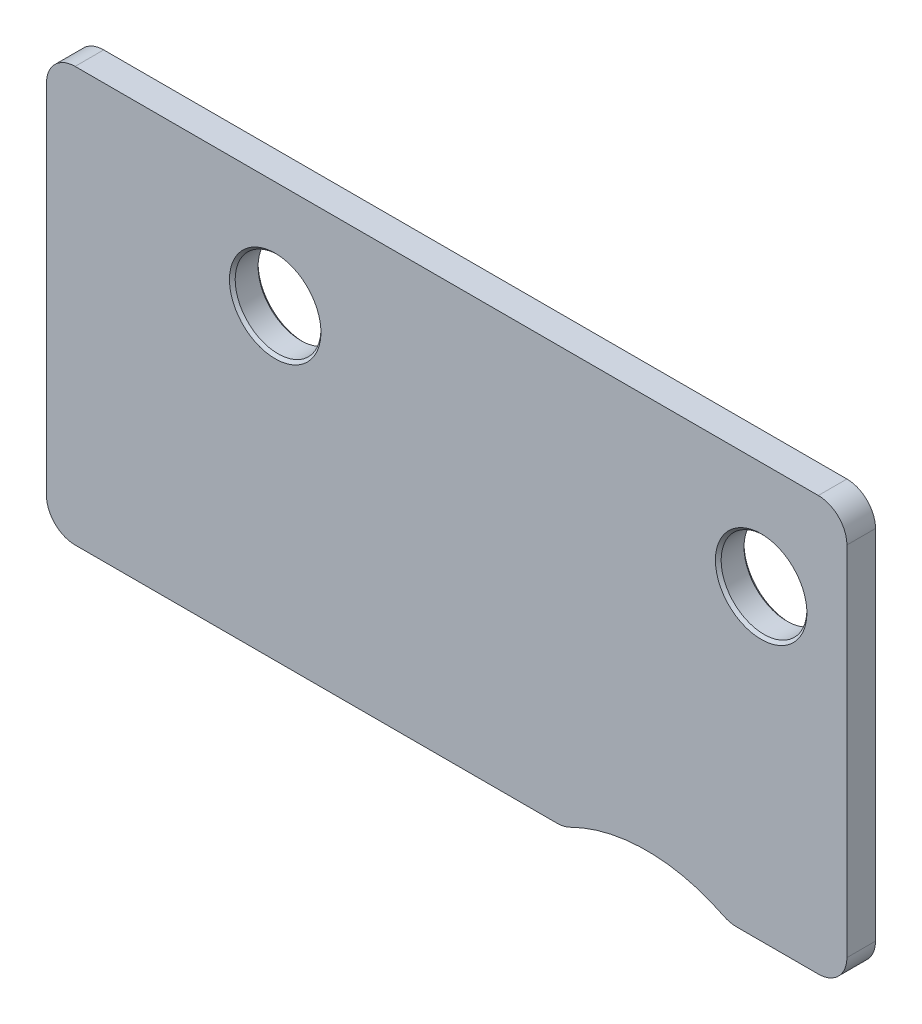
ISO-10303-21;
HEADER;
FILE_DESCRIPTION(('STEP AP214'),'2;1');
FILE_NAME('part.step','',(''),(''),'','','');
FILE_SCHEMA(('AUTOMOTIVE_DESIGN { 1 0 10303 214 1 1 1 1 }'));
ENDSEC;
DATA;
#1=APPLICATION_CONTEXT('core data for automotive mechanical design processes');
#2=APPLICATION_PROTOCOL_DEFINITION('international standard','automotive_design',2000,#1);
#3=PRODUCT_CONTEXT('',#1,'mechanical');
#4=PRODUCT('Part','Part','',(#3));
#5=PRODUCT_RELATED_PRODUCT_CATEGORY('part','',(#4));
#6=PRODUCT_DEFINITION_FORMATION('','',#4);
#7=PRODUCT_DEFINITION_CONTEXT('part definition',#1,'design');
#8=PRODUCT_DEFINITION('design','',#6,#7);
#9=PRODUCT_DEFINITION_SHAPE('','',#8);
#10=(LENGTH_UNIT() NAMED_UNIT(*) SI_UNIT(.MILLI.,.METRE.));
#11=(NAMED_UNIT(*) PLANE_ANGLE_UNIT() SI_UNIT($,.RADIAN.));
#12=(NAMED_UNIT(*) SI_UNIT($,.STERADIAN.) SOLID_ANGLE_UNIT());
#13=UNCERTAINTY_MEASURE_WITH_UNIT(LENGTH_MEASURE(1.E-05),#10,'distance_accuracy_value','');
#14=(GEOMETRIC_REPRESENTATION_CONTEXT(3) GLOBAL_UNCERTAINTY_ASSIGNED_CONTEXT((#13)) GLOBAL_UNIT_ASSIGNED_CONTEXT((#10,
#11,#12)) REPRESENTATION_CONTEXT('',''));
#15=CARTESIAN_POINT('',(0.,0.,0.));
#16=DIRECTION('',(0.,0.,1.));
#17=DIRECTION('',(1.,0.,0.));
#18=AXIS2_PLACEMENT_3D('',#15,#16,#17);
#19=CARTESIAN_POINT('',(21.,-19.7583187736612,1.));
#20=DIRECTION('',(0.,0.,-1.));
#21=DIRECTION('',(-1.,0.,0.));
#22=AXIS2_PLACEMENT_3D('',#19,#20,#21);
#23=PLANE('',#22);
#24=CARTESIAN_POINT('',(25.,-3.75831877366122,1.));
#25=DIRECTION('',(0.,0.,-1.));
#26=DIRECTION('',(-1.,0.,0.));
#27=AXIS2_PLACEMENT_3D('',#24,#25,#26);
#28=CIRCLE('',#27,1.6);
#29=CARTESIAN_POINT('',(23.4,-3.75831877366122,1.));
#30=VERTEX_POINT('',#29);
#31=EDGE_CURVE('E11',#30,#30,#28,.T.);
#32=ORIENTED_EDGE('',*,*,#31,.T.);
#33=EDGE_LOOP('',(#32));
#34=FACE_BOUND('',#33,.T.);
#35=CARTESIAN_POINT('',(8.,-3.75831877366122,1.));
#36=DIRECTION('',(0.,0.,-1.));
#37=DIRECTION('',(-1.,0.,0.));
#38=AXIS2_PLACEMENT_3D('',#35,#36,#37);
#39=CIRCLE('',#38,1.6);
#40=CARTESIAN_POINT('',(6.4,-3.75831877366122,1.));
#41=VERTEX_POINT('',#40);
#42=EDGE_CURVE('E370',#41,#41,#39,.T.);
#43=ORIENTED_EDGE('',*,*,#42,.T.);
#44=EDGE_LOOP('',(#43));
#45=FACE_BOUND('',#44,.T.);
#46=DIRECTION('',(1.,0.,0.));
#47=VECTOR('',#46,1.);
#48=CARTESIAN_POINT('',(0.,-14.5,1.));
#49=LINE('',#48,#47);
#50=CARTESIAN_POINT('',(1.,-14.5,1.));
#51=VERTEX_POINT('',#50);
#52=CARTESIAN_POINT('',(17.8641673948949,-14.5,1.));
#53=VERTEX_POINT('',#52);
#54=EDGE_CURVE('E496',#51,#53,#49,.T.);
#55=ORIENTED_EDGE('',*,*,#54,.T.);
#56=CARTESIAN_POINT('',(17.864167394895,-13.5,1.));
#57=DIRECTION('',(0.,0.,-1.));
#58=DIRECTION('',(-1.,0.,0.));
#59=AXIS2_PLACEMENT_3D('',#56,#57,#58);
#60=CIRCLE('',#59,1.);
#61=CARTESIAN_POINT('',(18.3121434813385,-14.3940455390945,1.));
#62=VERTEX_POINT('',#61);
#63=EDGE_CURVE('E528',#53,#62,#60,.F.);
#64=ORIENTED_EDGE('',*,*,#63,.T.);
#65=CARTESIAN_POINT('',(21.,-19.7583187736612,1.));
#66=DIRECTION('',(0.,0.,-1.));
#67=DIRECTION('',(-1.,0.,0.));
#68=AXIS2_PLACEMENT_3D('',#65,#66,#67);
#69=CIRCLE('',#68,6.);
#70=CARTESIAN_POINT('',(23.6878565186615,-14.3940455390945,1.));
#71=VERTEX_POINT('',#70);
#72=EDGE_CURVE('E473',#62,#71,#69,.T.);
#73=ORIENTED_EDGE('',*,*,#72,.T.);
#74=CARTESIAN_POINT('',(24.135832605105,-13.5,1.));
#75=DIRECTION('',(0.,0.,-1.));
#76=DIRECTION('',(-1.,0.,0.));
#77=AXIS2_PLACEMENT_3D('',#74,#75,#76);
#78=CIRCLE('',#77,1.);
#79=CARTESIAN_POINT('',(24.135832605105,-14.5,1.));
#80=VERTEX_POINT('',#79);
#81=EDGE_CURVE('E526',#71,#80,#78,.F.);
#82=ORIENTED_EDGE('',*,*,#81,.T.);
#83=DIRECTION('',(1.,0.,0.));
#84=VECTOR('',#83,1.);
#85=CARTESIAN_POINT('',(23.8896511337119,-14.5,1.));
#86=LINE('',#85,#84);
#87=CARTESIAN_POINT('',(27.,-14.5,1.));
#88=VERTEX_POINT('',#87);
#89=EDGE_CURVE('E500',#80,#88,#86,.T.);
#90=ORIENTED_EDGE('',*,*,#89,.T.);
#91=CARTESIAN_POINT('',(27.,-13.5,1.));
#92=DIRECTION('',(0.,0.,-1.));
#93=DIRECTION('',(-1.,0.,0.));
#94=AXIS2_PLACEMENT_3D('',#91,#92,#93);
#95=CIRCLE('',#94,1.);
#96=CARTESIAN_POINT('',(28.,-13.5,1.));
#97=VERTEX_POINT('',#96);
#98=EDGE_CURVE('E520',#88,#97,#95,.F.);
#99=ORIENTED_EDGE('',*,*,#98,.T.);
#100=DIRECTION('',(0.,1.,0.));
#101=VECTOR('',#100,1.);
#102=CARTESIAN_POINT('',(28.,0.,1.));
#103=LINE('',#102,#101);
#104=CARTESIAN_POINT('',(28.,-1.,1.));
#105=VERTEX_POINT('',#104);
#106=EDGE_CURVE('E503',#97,#105,#103,.T.);
#107=ORIENTED_EDGE('',*,*,#106,.T.);
#108=CARTESIAN_POINT('',(27.,-1.,1.));
#109=DIRECTION('',(0.,0.,-1.));
#110=DIRECTION('',(-1.,0.,0.));
#111=AXIS2_PLACEMENT_3D('',#108,#109,#110);
#112=CIRCLE('',#111,1.);
#113=CARTESIAN_POINT('',(27.,0.,1.));
#114=VERTEX_POINT('',#113);
#115=EDGE_CURVE('E384',#105,#114,#112,.F.);
#116=ORIENTED_EDGE('',*,*,#115,.T.);
#117=DIRECTION('',(-1.,0.,0.));
#118=VECTOR('',#117,1.);
#119=CARTESIAN_POINT('',(0.,0.,1.));
#120=LINE('',#119,#118);
#121=CARTESIAN_POINT('',(1.,0.,1.));
#122=VERTEX_POINT('',#121);
#123=EDGE_CURVE('E505',#114,#122,#120,.T.);
#124=ORIENTED_EDGE('',*,*,#123,.T.);
#125=CARTESIAN_POINT('',(1.,-1.,1.));
#126=DIRECTION('',(0.,0.,-1.));
#127=DIRECTION('',(-1.,0.,0.));
#128=AXIS2_PLACEMENT_3D('',#125,#126,#127);
#129=CIRCLE('',#128,1.);
#130=CARTESIAN_POINT('',(0.,-1.,1.));
#131=VERTEX_POINT('',#130);
#132=EDGE_CURVE('E524',#122,#131,#129,.F.);
#133=ORIENTED_EDGE('',*,*,#132,.T.);
#134=DIRECTION('',(0.,-1.,0.));
#135=VECTOR('',#134,1.);
#136=CARTESIAN_POINT('',(0.,0.,1.));
#137=LINE('',#136,#135);
#138=CARTESIAN_POINT('',(0.,-13.5,1.));
#139=VERTEX_POINT('',#138);
#140=EDGE_CURVE('E493',#131,#139,#137,.T.);
#141=ORIENTED_EDGE('',*,*,#140,.T.);
#142=CARTESIAN_POINT('',(1.,-13.5,1.));
#143=DIRECTION('',(0.,0.,-1.));
#144=DIRECTION('',(-1.,0.,0.));
#145=AXIS2_PLACEMENT_3D('',#142,#143,#144);
#146=CIRCLE('',#145,1.);
#147=EDGE_CURVE('E522',#139,#51,#146,.F.);
#148=ORIENTED_EDGE('',*,*,#147,.T.);
#149=EDGE_LOOP('',(#55,#64,#73,#82,#90,#99,#107,#116,#124,#133,#141,#148));
#150=FACE_BOUND('',#149,.T.);
#151=ADVANCED_FACE('F362',(#34,#45,#150),#23,.F.);
#152=CARTESIAN_POINT('',(21.,-19.7583187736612,0.));
#153=DIRECTION('',(0.,0.,-1.));
#154=DIRECTION('',(-1.,0.,0.));
#155=AXIS2_PLACEMENT_3D('',#152,#153,#154);
#156=PLANE('',#155);
#157=CARTESIAN_POINT('',(8.,-3.75831877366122,0.));
#158=DIRECTION('',(0.,0.,-1.));
#159=DIRECTION('',(-1.,0.,0.));
#160=AXIS2_PLACEMENT_3D('',#157,#158,#159);
#161=CIRCLE('',#160,1.6);
#162=CARTESIAN_POINT('',(6.4,-3.75831877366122,0.));
#163=VERTEX_POINT('',#162);
#164=EDGE_CURVE('E552',#163,#163,#161,.F.);
#165=ORIENTED_EDGE('',*,*,#164,.T.);
#166=EDGE_LOOP('',(#165));
#167=FACE_BOUND('',#166,.T.);
#168=CARTESIAN_POINT('',(25.,-3.75831877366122,0.));
#169=DIRECTION('',(0.,0.,-1.));
#170=DIRECTION('',(-1.,0.,0.));
#171=AXIS2_PLACEMENT_3D('',#168,#169,#170);
#172=CIRCLE('',#171,1.6);
#173=CARTESIAN_POINT('',(23.4,-3.75831877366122,0.));
#174=VERTEX_POINT('',#173);
#175=EDGE_CURVE('E549',#174,#174,#172,.F.);
#176=ORIENTED_EDGE('',*,*,#175,.T.);
#177=EDGE_LOOP('',(#176));
#178=FACE_BOUND('',#177,.T.);
#179=CARTESIAN_POINT('',(21.,-19.7583187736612,0.));
#180=DIRECTION('',(0.,0.,-1.));
#181=DIRECTION('',(-1.,0.,0.));
#182=AXIS2_PLACEMENT_3D('',#179,#180,#181);
#183=CIRCLE('',#182,6.);
#184=CARTESIAN_POINT('',(18.3121434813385,-14.3940455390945,0.));
#185=VERTEX_POINT('',#184);
#186=CARTESIAN_POINT('',(23.6878565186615,-14.3940455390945,0.));
#187=VERTEX_POINT('',#186);
#188=EDGE_CURVE('E470',#185,#187,#183,.T.);
#189=ORIENTED_EDGE('',*,*,#188,.F.);
#190=CARTESIAN_POINT('',(17.864167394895,-13.5,0.));
#191=DIRECTION('',(0.,0.,-1.));
#192=DIRECTION('',(-1.,0.,0.));
#193=AXIS2_PLACEMENT_3D('',#190,#191,#192);
#194=CIRCLE('',#193,1.);
#195=CARTESIAN_POINT('',(17.8641673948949,-14.5,0.));
#196=VERTEX_POINT('',#195);
#197=EDGE_CURVE('E453',#185,#196,#194,.T.);
#198=ORIENTED_EDGE('',*,*,#197,.T.);
#199=DIRECTION('',(1.,0.,0.));
#200=VECTOR('',#199,1.);
#201=CARTESIAN_POINT('',(0.,-14.5,0.));
#202=LINE('',#201,#200);
#203=CARTESIAN_POINT('',(1.,-14.5,0.));
#204=VERTEX_POINT('',#203);
#205=EDGE_CURVE('E480',#204,#196,#202,.T.);
#206=ORIENTED_EDGE('',*,*,#205,.F.);
#207=CARTESIAN_POINT('',(1.,-13.5,0.));
#208=DIRECTION('',(0.,0.,-1.));
#209=DIRECTION('',(-1.,0.,0.));
#210=AXIS2_PLACEMENT_3D('',#207,#208,#209);
#211=CIRCLE('',#210,1.);
#212=CARTESIAN_POINT('',(0.,-13.5,0.));
#213=VERTEX_POINT('',#212);
#214=EDGE_CURVE('E511',#204,#213,#211,.T.);
#215=ORIENTED_EDGE('',*,*,#214,.T.);
#216=DIRECTION('',(0.,-1.,0.));
#217=VECTOR('',#216,1.);
#218=CARTESIAN_POINT('',(0.,0.,0.));
#219=LINE('',#218,#217);
#220=CARTESIAN_POINT('',(0.,-1.,0.));
#221=VERTEX_POINT('',#220);
#222=EDGE_CURVE('E485',#221,#213,#219,.T.);
#223=ORIENTED_EDGE('',*,*,#222,.F.);
#224=CARTESIAN_POINT('',(1.,-1.,0.));
#225=DIRECTION('',(0.,0.,-1.));
#226=DIRECTION('',(-1.,0.,0.));
#227=AXIS2_PLACEMENT_3D('',#224,#225,#226);
#228=CIRCLE('',#227,1.);
#229=CARTESIAN_POINT('',(1.,0.,0.));
#230=VERTEX_POINT('',#229);
#231=EDGE_CURVE('E513',#221,#230,#228,.T.);
#232=ORIENTED_EDGE('',*,*,#231,.T.);
#233=DIRECTION('',(-1.,0.,0.));
#234=VECTOR('',#233,1.);
#235=CARTESIAN_POINT('',(0.,0.,0.));
#236=LINE('',#235,#234);
#237=CARTESIAN_POINT('',(27.,0.,0.));
#238=VERTEX_POINT('',#237);
#239=EDGE_CURVE('E491',#238,#230,#236,.T.);
#240=ORIENTED_EDGE('',*,*,#239,.F.);
#241=CARTESIAN_POINT('',(27.,-1.,0.));
#242=DIRECTION('',(0.,0.,-1.));
#243=DIRECTION('',(-1.,0.,0.));
#244=AXIS2_PLACEMENT_3D('',#241,#242,#243);
#245=CIRCLE('',#244,1.);
#246=CARTESIAN_POINT('',(28.,-1.,0.));
#247=VERTEX_POINT('',#246);
#248=EDGE_CURVE('E474',#238,#247,#245,.T.);
#249=ORIENTED_EDGE('',*,*,#248,.T.);
#250=DIRECTION('',(0.,1.,0.));
#251=VECTOR('',#250,1.);
#252=CARTESIAN_POINT('',(28.,0.,0.));
#253=LINE('',#252,#251);
#254=CARTESIAN_POINT('',(28.,-13.5,0.));
#255=VERTEX_POINT('',#254);
#256=EDGE_CURVE('E483',#255,#247,#253,.T.);
#257=ORIENTED_EDGE('',*,*,#256,.F.);
#258=CARTESIAN_POINT('',(27.,-13.5,0.));
#259=DIRECTION('',(0.,0.,-1.));
#260=DIRECTION('',(-1.,0.,0.));
#261=AXIS2_PLACEMENT_3D('',#258,#259,#260);
#262=CIRCLE('',#261,1.);
#263=CARTESIAN_POINT('',(27.,-14.5,0.));
#264=VERTEX_POINT('',#263);
#265=EDGE_CURVE('E509',#255,#264,#262,.T.);
#266=ORIENTED_EDGE('',*,*,#265,.T.);
#267=DIRECTION('',(1.,0.,0.));
#268=VECTOR('',#267,1.);
#269=CARTESIAN_POINT('',(23.8896511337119,-14.5,0.));
#270=LINE('',#269,#268);
#271=CARTESIAN_POINT('',(24.135832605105,-14.5,0.));
#272=VERTEX_POINT('',#271);
#273=EDGE_CURVE('E479',#272,#264,#270,.T.);
#274=ORIENTED_EDGE('',*,*,#273,.F.);
#275=CARTESIAN_POINT('',(24.135832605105,-13.5,0.));
#276=DIRECTION('',(0.,0.,-1.));
#277=DIRECTION('',(-1.,0.,0.));
#278=AXIS2_PLACEMENT_3D('',#275,#276,#277);
#279=CIRCLE('',#278,1.);
#280=EDGE_CURVE('E464',#272,#187,#279,.T.);
#281=ORIENTED_EDGE('',*,*,#280,.T.);
#282=EDGE_LOOP('',(#189,#198,#206,#215,#223,#232,#240,#249,#257,#266,#274,#281));
#283=FACE_BOUND('',#282,.T.);
#284=ADVANCED_FACE('F477',(#167,#178,#283),#156,.T.);
#285=CARTESIAN_POINT('',(0.,0.,1.));
#286=DIRECTION('',(1.,0.,0.));
#287=DIRECTION('',(0.,1.,0.));
#288=AXIS2_PLACEMENT_3D('',#285,#286,#287);
#289=PLANE('',#288);
#290=ORIENTED_EDGE('',*,*,#140,.F.);
#291=DIRECTION('',(0.,0.,-1.));
#292=VECTOR('',#291,1.);
#293=CARTESIAN_POINT('',(0.,-1.,1.));
#294=LINE('',#293,#292);
#295=EDGE_CURVE('E537',#131,#221,#294,.T.);
#296=ORIENTED_EDGE('',*,*,#295,.T.);
#297=ORIENTED_EDGE('',*,*,#222,.T.);
#298=DIRECTION('',(0.,0.,-1.));
#299=VECTOR('',#298,1.);
#300=CARTESIAN_POINT('',(0.,-13.5,1.));
#301=LINE('',#300,#299);
#302=EDGE_CURVE('E535',#213,#139,#301,.F.);
#303=ORIENTED_EDGE('',*,*,#302,.T.);
#304=EDGE_LOOP('',(#290,#296,#297,#303));
#305=FACE_BOUND('',#304,.T.);
#306=ADVANCED_FACE('F364',(#305),#289,.F.);
#307=CARTESIAN_POINT('',(0.,-14.5,1.));
#308=DIRECTION('',(0.,1.,0.));
#309=DIRECTION('',(0.,0.,1.));
#310=AXIS2_PLACEMENT_3D('',#307,#308,#309);
#311=PLANE('',#310);
#312=ORIENTED_EDGE('',*,*,#205,.T.);
#313=DIRECTION('',(0.,0.,-1.));
#314=VECTOR('',#313,1.);
#315=CARTESIAN_POINT('',(17.864167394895,-14.5,1.));
#316=LINE('',#315,#314);
#317=EDGE_CURVE('E458',#196,#53,#316,.F.);
#318=ORIENTED_EDGE('',*,*,#317,.T.);
#319=ORIENTED_EDGE('',*,*,#54,.F.);
#320=DIRECTION('',(0.,0.,-1.));
#321=VECTOR('',#320,1.);
#322=CARTESIAN_POINT('',(1.,-14.5,1.));
#323=LINE('',#322,#321);
#324=EDGE_CURVE('E463',#51,#204,#323,.T.);
#325=ORIENTED_EDGE('',*,*,#324,.T.);
#326=EDGE_LOOP('',(#312,#318,#319,#325));
#327=FACE_BOUND('',#326,.T.);
#328=ADVANCED_FACE('F613',(#327),#311,.F.);
#329=CARTESIAN_POINT('',(21.,-19.7583187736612,1.));
#330=DIRECTION('',(0.,0.,-1.));
#331=DIRECTION('',(-1.,0.,0.));
#332=AXIS2_PLACEMENT_3D('',#329,#330,#331);
#333=CYLINDRICAL_SURFACE('',#332,6.);
#334=ORIENTED_EDGE('',*,*,#72,.F.);
#335=DIRECTION('',(0.,0.,-1.));
#336=VECTOR('',#335,1.);
#337=CARTESIAN_POINT('',(18.3121434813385,-14.3940455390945,1.));
#338=LINE('',#337,#336);
#339=EDGE_CURVE('E457',#62,#185,#338,.T.);
#340=ORIENTED_EDGE('',*,*,#339,.T.);
#341=ORIENTED_EDGE('',*,*,#188,.T.);
#342=DIRECTION('',(0.,0.,-1.));
#343=VECTOR('',#342,1.);
#344=CARTESIAN_POINT('',(23.6878565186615,-14.3940455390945,1.));
#345=LINE('',#344,#343);
#346=EDGE_CURVE('E475',#187,#71,#345,.F.);
#347=ORIENTED_EDGE('',*,*,#346,.T.);
#348=EDGE_LOOP('',(#334,#340,#341,#347));
#349=FACE_BOUND('',#348,.T.);
#350=ADVANCED_FACE('F469',(#349),#333,.F.);
#351=CARTESIAN_POINT('',(23.8896511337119,-14.5,1.));
#352=DIRECTION('',(0.,1.,0.));
#353=DIRECTION('',(0.,0.,1.));
#354=AXIS2_PLACEMENT_3D('',#351,#352,#353);
#355=PLANE('',#354);
#356=ORIENTED_EDGE('',*,*,#89,.F.);
#357=DIRECTION('',(0.,0.,-1.));
#358=VECTOR('',#357,1.);
#359=CARTESIAN_POINT('',(24.135832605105,-14.5,1.));
#360=LINE('',#359,#358);
#361=EDGE_CURVE('E532',#80,#272,#360,.T.);
#362=ORIENTED_EDGE('',*,*,#361,.T.);
#363=ORIENTED_EDGE('',*,*,#273,.T.);
#364=DIRECTION('',(0.,0.,-1.));
#365=VECTOR('',#364,1.);
#366=CARTESIAN_POINT('',(27.,-14.5,1.));
#367=LINE('',#366,#365);
#368=EDGE_CURVE('E530',#264,#88,#367,.F.);
#369=ORIENTED_EDGE('',*,*,#368,.T.);
#370=EDGE_LOOP('',(#356,#362,#363,#369));
#371=FACE_BOUND('',#370,.T.);
#372=ADVANCED_FACE('F607',(#371),#355,.F.);
#373=CARTESIAN_POINT('',(28.,0.,1.));
#374=DIRECTION('',(-1.,0.,0.));
#375=DIRECTION('',(0.,-1.,0.));
#376=AXIS2_PLACEMENT_3D('',#373,#374,#375);
#377=PLANE('',#376);
#378=ORIENTED_EDGE('',*,*,#106,.F.);
#379=DIRECTION('',(0.,0.,-1.));
#380=VECTOR('',#379,1.);
#381=CARTESIAN_POINT('',(28.,-13.5,1.));
#382=LINE('',#381,#380);
#383=EDGE_CURVE('E546',#97,#255,#382,.T.);
#384=ORIENTED_EDGE('',*,*,#383,.T.);
#385=ORIENTED_EDGE('',*,*,#256,.T.);
#386=DIRECTION('',(0.,0.,-1.));
#387=VECTOR('',#386,1.);
#388=CARTESIAN_POINT('',(28.,-1.,1.));
#389=LINE('',#388,#387);
#390=EDGE_CURVE('E544',#247,#105,#389,.F.);
#391=ORIENTED_EDGE('',*,*,#390,.T.);
#392=EDGE_LOOP('',(#378,#384,#385,#391));
#393=FACE_BOUND('',#392,.T.);
#394=ADVANCED_FACE('F604',(#393),#377,.F.);
#395=CARTESIAN_POINT('',(0.,0.,1.));
#396=DIRECTION('',(0.,-1.,0.));
#397=DIRECTION('',(0.,0.,-1.));
#398=AXIS2_PLACEMENT_3D('',#395,#396,#397);
#399=PLANE('',#398);
#400=ORIENTED_EDGE('',*,*,#239,.T.);
#401=DIRECTION('',(0.,0.,-1.));
#402=VECTOR('',#401,1.);
#403=CARTESIAN_POINT('',(1.,0.,1.));
#404=LINE('',#403,#402);
#405=EDGE_CURVE('E377',#230,#122,#404,.F.);
#406=ORIENTED_EDGE('',*,*,#405,.T.);
#407=ORIENTED_EDGE('',*,*,#123,.F.);
#408=DIRECTION('',(0.,0.,-1.));
#409=VECTOR('',#408,1.);
#410=CARTESIAN_POINT('',(27.,0.,1.));
#411=LINE('',#410,#409);
#412=EDGE_CURVE('E540',#114,#238,#411,.T.);
#413=ORIENTED_EDGE('',*,*,#412,.T.);
#414=EDGE_LOOP('',(#400,#406,#407,#413));
#415=FACE_BOUND('',#414,.T.);
#416=ADVANCED_FACE('F589',(#415),#399,.F.);
#417=CARTESIAN_POINT('',(25.,-3.75831877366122,1.));
#418=DIRECTION('',(0.,0.,-1.));
#419=DIRECTION('',(-1.,0.,0.));
#420=AXIS2_PLACEMENT_3D('',#417,#418,#419);
#421=CYLINDRICAL_SURFACE('',#420,1.5);
#422=CARTESIAN_POINT('',(25.,-3.75831877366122,0.100000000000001));
#423=DIRECTION('',(0.,0.,-1.));
#424=DIRECTION('',(-1.,0.,0.));
#425=AXIS2_PLACEMENT_3D('',#422,#423,#424);
#426=CIRCLE('',#425,1.5);
#427=CARTESIAN_POINT('',(23.5,-3.75831877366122,0.100000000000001));
#428=VERTEX_POINT('',#427);
#429=EDGE_CURVE('E564',#428,#428,#426,.T.);
#430=ORIENTED_EDGE('',*,*,#429,.T.);
#431=EDGE_LOOP('',(#430));
#432=FACE_BOUND('',#431,.T.);
#433=CARTESIAN_POINT('',(25.,-3.75831877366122,0.9));
#434=DIRECTION('',(0.,0.,-1.));
#435=DIRECTION('',(-1.,0.,0.));
#436=AXIS2_PLACEMENT_3D('',#433,#434,#435);
#437=CIRCLE('',#436,1.5);
#438=CARTESIAN_POINT('',(23.5,-3.75831877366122,0.9));
#439=VERTEX_POINT('',#438);
#440=EDGE_CURVE('E561',#439,#439,#437,.F.);
#441=ORIENTED_EDGE('',*,*,#440,.T.);
#442=EDGE_LOOP('',(#441));
#443=FACE_BOUND('',#442,.T.);
#444=ADVANCED_FACE('F579',(#432,#443),#421,.F.);
#445=CARTESIAN_POINT('',(8.,-3.75831877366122,1.));
#446=DIRECTION('',(0.,0.,-1.));
#447=DIRECTION('',(-1.,0.,0.));
#448=AXIS2_PLACEMENT_3D('',#445,#446,#447);
#449=CYLINDRICAL_SURFACE('',#448,1.5);
#450=CARTESIAN_POINT('',(8.,-3.75831877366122,0.1));
#451=DIRECTION('',(0.,0.,-1.));
#452=DIRECTION('',(-1.,0.,0.));
#453=AXIS2_PLACEMENT_3D('',#450,#451,#452);
#454=CIRCLE('',#453,1.5);
#455=CARTESIAN_POINT('',(6.5,-3.75831877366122,0.1));
#456=VERTEX_POINT('',#455);
#457=EDGE_CURVE('E558',#456,#456,#454,.T.);
#458=ORIENTED_EDGE('',*,*,#457,.T.);
#459=EDGE_LOOP('',(#458));
#460=FACE_BOUND('',#459,.T.);
#461=CARTESIAN_POINT('',(8.,-3.75831877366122,0.9));
#462=DIRECTION('',(0.,0.,-1.));
#463=DIRECTION('',(-1.,0.,0.));
#464=AXIS2_PLACEMENT_3D('',#461,#462,#463);
#465=CIRCLE('',#464,1.5);
#466=CARTESIAN_POINT('',(6.5,-3.75831877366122,0.9));
#467=VERTEX_POINT('',#466);
#468=EDGE_CURVE('E555',#467,#467,#465,.F.);
#469=ORIENTED_EDGE('',*,*,#468,.T.);
#470=EDGE_LOOP('',(#469));
#471=FACE_BOUND('',#470,.T.);
#472=ADVANCED_FACE('F577',(#460,#471),#449,.F.);
#473=CARTESIAN_POINT('',(17.864167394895,-13.5,1.));
#474=DIRECTION('',(0.,0.,-1.));
#475=DIRECTION('',(-1.,0.,0.));
#476=AXIS2_PLACEMENT_3D('',#473,#474,#475);
#477=CYLINDRICAL_SURFACE('',#476,1.);
#478=ORIENTED_EDGE('',*,*,#63,.F.);
#479=ORIENTED_EDGE('',*,*,#317,.F.);
#480=ORIENTED_EDGE('',*,*,#197,.F.);
#481=ORIENTED_EDGE('',*,*,#339,.F.);
#482=EDGE_LOOP('',(#478,#479,#480,#481));
#483=FACE_BOUND('',#482,.T.);
#484=ADVANCED_FACE('F456',(#483),#477,.T.);
#485=CARTESIAN_POINT('',(24.135832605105,-13.5,1.));
#486=DIRECTION('',(0.,0.,-1.));
#487=DIRECTION('',(-1.,0.,0.));
#488=AXIS2_PLACEMENT_3D('',#485,#486,#487);
#489=CYLINDRICAL_SURFACE('',#488,1.);
#490=ORIENTED_EDGE('',*,*,#81,.F.);
#491=ORIENTED_EDGE('',*,*,#346,.F.);
#492=ORIENTED_EDGE('',*,*,#280,.F.);
#493=ORIENTED_EDGE('',*,*,#361,.F.);
#494=EDGE_LOOP('',(#490,#491,#492,#493));
#495=FACE_BOUND('',#494,.T.);
#496=ADVANCED_FACE('F587',(#495),#489,.T.);
#497=CARTESIAN_POINT('',(1.,-1.,1.));
#498=DIRECTION('',(0.,0.,-1.));
#499=DIRECTION('',(-1.,0.,0.));
#500=AXIS2_PLACEMENT_3D('',#497,#498,#499);
#501=CYLINDRICAL_SURFACE('',#500,1.);
#502=ORIENTED_EDGE('',*,*,#132,.F.);
#503=ORIENTED_EDGE('',*,*,#405,.F.);
#504=ORIENTED_EDGE('',*,*,#231,.F.);
#505=ORIENTED_EDGE('',*,*,#295,.F.);
#506=EDGE_LOOP('',(#502,#503,#504,#505));
#507=FACE_BOUND('',#506,.T.);
#508=ADVANCED_FACE('F632',(#507),#501,.T.);
#509=CARTESIAN_POINT('',(1.,-13.5,1.));
#510=DIRECTION('',(0.,0.,-1.));
#511=DIRECTION('',(-1.,0.,0.));
#512=AXIS2_PLACEMENT_3D('',#509,#510,#511);
#513=CYLINDRICAL_SURFACE('',#512,1.);
#514=ORIENTED_EDGE('',*,*,#147,.F.);
#515=ORIENTED_EDGE('',*,*,#302,.F.);
#516=ORIENTED_EDGE('',*,*,#214,.F.);
#517=ORIENTED_EDGE('',*,*,#324,.F.);
#518=EDGE_LOOP('',(#514,#515,#516,#517));
#519=FACE_BOUND('',#518,.T.);
#520=ADVANCED_FACE('F629',(#519),#513,.T.);
#521=CARTESIAN_POINT('',(27.,-13.5,1.));
#522=DIRECTION('',(0.,0.,-1.));
#523=DIRECTION('',(-1.,0.,0.));
#524=AXIS2_PLACEMENT_3D('',#521,#522,#523);
#525=CYLINDRICAL_SURFACE('',#524,1.);
#526=ORIENTED_EDGE('',*,*,#98,.F.);
#527=ORIENTED_EDGE('',*,*,#368,.F.);
#528=ORIENTED_EDGE('',*,*,#265,.F.);
#529=ORIENTED_EDGE('',*,*,#383,.F.);
#530=EDGE_LOOP('',(#526,#527,#528,#529));
#531=FACE_BOUND('',#530,.T.);
#532=ADVANCED_FACE('F643',(#531),#525,.T.);
#533=CARTESIAN_POINT('',(27.,-1.,1.));
#534=DIRECTION('',(0.,0.,-1.));
#535=DIRECTION('',(-1.,0.,0.));
#536=AXIS2_PLACEMENT_3D('',#533,#534,#535);
#537=CYLINDRICAL_SURFACE('',#536,1.);
#538=ORIENTED_EDGE('',*,*,#115,.F.);
#539=ORIENTED_EDGE('',*,*,#390,.F.);
#540=ORIENTED_EDGE('',*,*,#248,.F.);
#541=ORIENTED_EDGE('',*,*,#412,.F.);
#542=EDGE_LOOP('',(#538,#539,#540,#541));
#543=FACE_BOUND('',#542,.T.);
#544=ADVANCED_FACE('F636',(#543),#537,.T.);
#545=CARTESIAN_POINT('',(8.,-3.75831877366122,0.));
#546=DIRECTION('',(0.,0.,-1.));
#547=DIRECTION('',(-1.,0.,0.));
#548=AXIS2_PLACEMENT_3D('',#545,#546,#547);
#549=CONICAL_SURFACE('',#548,1.6,0.785398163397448);
#550=ORIENTED_EDGE('',*,*,#457,.F.);
#551=EDGE_LOOP('',(#550));
#552=FACE_BOUND('',#551,.T.);
#553=ORIENTED_EDGE('',*,*,#164,.F.);
#554=EDGE_LOOP('',(#553));
#555=FACE_BOUND('',#554,.T.);
#556=ADVANCED_FACE('F661',(#552,#555),#549,.F.);
#557=CARTESIAN_POINT('',(25.,-3.75831877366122,0.));
#558=DIRECTION('',(0.,0.,-1.));
#559=DIRECTION('',(-1.,0.,0.));
#560=AXIS2_PLACEMENT_3D('',#557,#558,#559);
#561=CONICAL_SURFACE('',#560,1.6,0.785398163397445);
#562=ORIENTED_EDGE('',*,*,#429,.F.);
#563=EDGE_LOOP('',(#562));
#564=FACE_BOUND('',#563,.T.);
#565=ORIENTED_EDGE('',*,*,#175,.F.);
#566=EDGE_LOOP('',(#565));
#567=FACE_BOUND('',#566,.T.);
#568=ADVANCED_FACE('F663',(#564,#567),#561,.F.);
#569=CARTESIAN_POINT('',(25.,-3.75831877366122,0.9));
#570=DIRECTION('',(0.,0.,1.));
#571=DIRECTION('',(1.,0.,0.));
#572=AXIS2_PLACEMENT_3D('',#569,#570,#571);
#573=CONICAL_SURFACE('',#572,1.5,0.785398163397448);
#574=ORIENTED_EDGE('',*,*,#31,.F.);
#575=EDGE_LOOP('',(#574));
#576=FACE_BOUND('',#575,.T.);
#577=ORIENTED_EDGE('',*,*,#440,.F.);
#578=EDGE_LOOP('',(#577));
#579=FACE_BOUND('',#578,.T.);
#580=ADVANCED_FACE('F573',(#576,#579),#573,.F.);
#581=CARTESIAN_POINT('',(8.,-3.75831877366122,0.9));
#582=DIRECTION('',(0.,0.,1.));
#583=DIRECTION('',(1.,0.,0.));
#584=AXIS2_PLACEMENT_3D('',#581,#582,#583);
#585=CONICAL_SURFACE('',#584,1.5,0.785398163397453);
#586=ORIENTED_EDGE('',*,*,#42,.F.);
#587=EDGE_LOOP('',(#586));
#588=FACE_BOUND('',#587,.T.);
#589=ORIENTED_EDGE('',*,*,#468,.F.);
#590=EDGE_LOOP('',(#589));
#591=FACE_BOUND('',#590,.T.);
#592=ADVANCED_FACE('F570',(#588,#591),#585,.F.);
#593=CLOSED_SHELL('',(#151,#284,#306,#328,#350,#372,#394,#416,#444,#472,#484,#496,#508,#520,
#532,#544,#556,#568,#580,#592));
#594=MANIFOLD_SOLID_BREP('B2',#593);
#595=ADVANCED_BREP_SHAPE_REPRESENTATION('',(#18,#594),#14);
#596=SHAPE_DEFINITION_REPRESENTATION(#9,#595);
ENDSEC;
END-ISO-10303-21;
